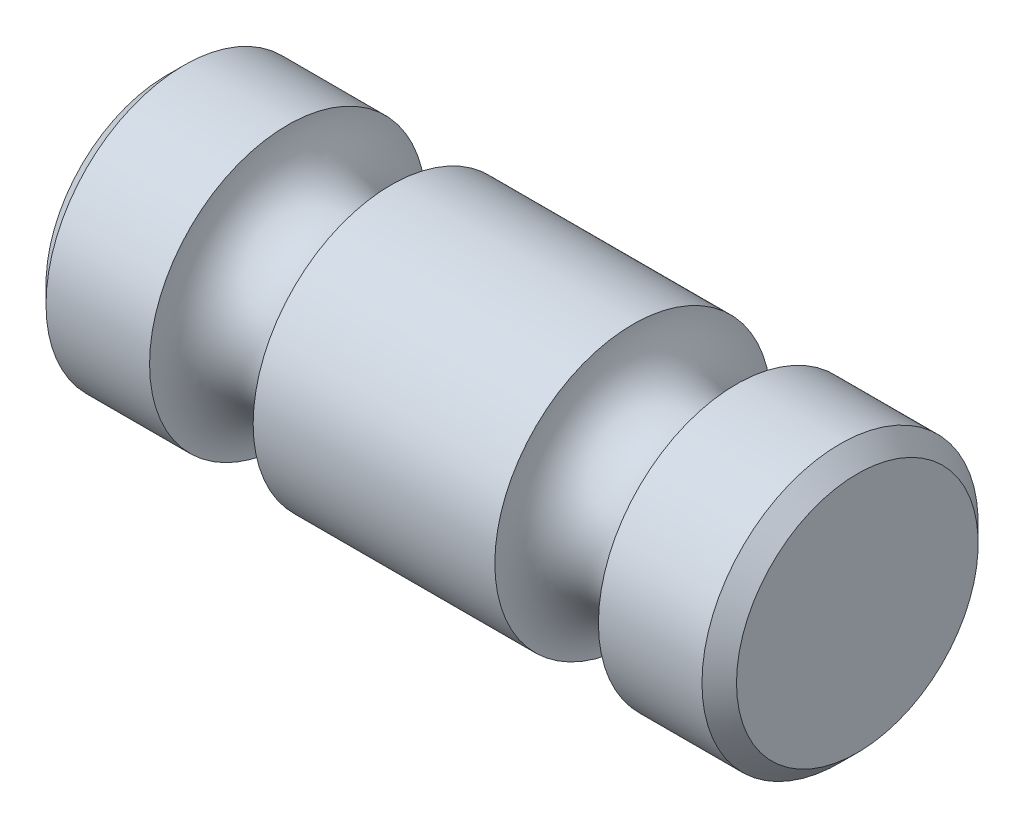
ISO-10303-21;
HEADER;
FILE_DESCRIPTION(('STEP AP214'),'2;1');
FILE_NAME('part.step','',(''),(''),'','','');
FILE_SCHEMA(('AUTOMOTIVE_DESIGN { 1 0 10303 214 1 1 1 1 }'));
ENDSEC;
DATA;
#1=APPLICATION_CONTEXT('core data for automotive mechanical design processes');
#2=APPLICATION_PROTOCOL_DEFINITION('international standard','automotive_design',2000,#1);
#3=PRODUCT_CONTEXT('',#1,'mechanical');
#4=PRODUCT('Part','Part','',(#3));
#5=PRODUCT_RELATED_PRODUCT_CATEGORY('part','',(#4));
#6=PRODUCT_DEFINITION_FORMATION('','',#4);
#7=PRODUCT_DEFINITION_CONTEXT('part definition',#1,'design');
#8=PRODUCT_DEFINITION('design','',#6,#7);
#9=PRODUCT_DEFINITION_SHAPE('','',#8);
#10=(LENGTH_UNIT() NAMED_UNIT(*) SI_UNIT(.MILLI.,.METRE.));
#11=(NAMED_UNIT(*) PLANE_ANGLE_UNIT() SI_UNIT($,.RADIAN.));
#12=(NAMED_UNIT(*) SI_UNIT($,.STERADIAN.) SOLID_ANGLE_UNIT());
#13=UNCERTAINTY_MEASURE_WITH_UNIT(LENGTH_MEASURE(1.E-05),#10,'distance_accuracy_value','');
#14=(GEOMETRIC_REPRESENTATION_CONTEXT(3) GLOBAL_UNCERTAINTY_ASSIGNED_CONTEXT((#13)) GLOBAL_UNIT_ASSIGNED_CONTEXT((#10,
#11,#12)) REPRESENTATION_CONTEXT('',''));
#15=CARTESIAN_POINT('',(0.,0.,0.));
#16=DIRECTION('',(0.,0.,1.));
#17=DIRECTION('',(1.,0.,0.));
#18=AXIS2_PLACEMENT_3D('',#15,#16,#17);
#19=CARTESIAN_POINT('',(-57.3101318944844,14.3483436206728,0.));
#20=DIRECTION('',(1.,0.,0.));
#21=DIRECTION('',(0.,0.,-1.));
#22=AXIS2_PLACEMENT_3D('',#19,#20,#21);
#23=PLANE('',#22);
#24=CARTESIAN_POINT('',(-57.3101318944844,6.34834362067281,0.));
#25=DIRECTION('',(1.,0.,0.));
#26=DIRECTION('',(0.,0.,-1.));
#27=AXIS2_PLACEMENT_3D('',#24,#25,#26);
#28=CIRCLE('',#27,7.);
#29=CARTESIAN_POINT('',(-57.3101318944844,6.34834362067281,-7.));
#30=VERTEX_POINT('',#29);
#31=EDGE_CURVE('E34',#30,#30,#28,.F.);
#32=ORIENTED_EDGE('',*,*,#31,.T.);
#33=EDGE_LOOP('',(#32));
#34=FACE_BOUND('',#33,.T.);
#35=ADVANCED_FACE('F28',(#34),#23,.F.);
#36=CARTESIAN_POINT('',(-17.3101318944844,6.34834362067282,0.));
#37=DIRECTION('',(-1.,0.,0.));
#38=DIRECTION('',(0.,0.,1.));
#39=AXIS2_PLACEMENT_3D('',#36,#37,#38);
#40=PLANE('',#39);
#41=CARTESIAN_POINT('',(-17.3101318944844,6.34834362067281,0.));
#42=DIRECTION('',(-1.,0.,0.));
#43=DIRECTION('',(0.,0.,1.));
#44=AXIS2_PLACEMENT_3D('',#41,#42,#43);
#45=CIRCLE('',#44,6.99999999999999);
#46=CARTESIAN_POINT('',(-17.3101318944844,6.34834362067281,6.99999999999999));
#47=VERTEX_POINT('',#46);
#48=EDGE_CURVE('E38',#47,#47,#45,.F.);
#49=ORIENTED_EDGE('',*,*,#48,.T.);
#50=EDGE_LOOP('',(#49));
#51=FACE_BOUND('',#50,.T.);
#52=ADVANCED_FACE('F82',(#51),#40,.F.);
#53=CARTESIAN_POINT('',(-63.2212490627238,6.34834362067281,0.));
#54=DIRECTION('',(-1.,0.,0.));
#55=DIRECTION('',(0.,0.,1.));
#56=AXIS2_PLACEMENT_3D('',#53,#54,#55);
#57=CYLINDRICAL_SURFACE('',#56,8.);
#58=CARTESIAN_POINT('',(-18.3101318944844,6.34834362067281,0.));
#59=DIRECTION('',(-1.,0.,0.));
#60=DIRECTION('',(0.,0.,1.));
#61=AXIS2_PLACEMENT_3D('',#58,#59,#60);
#62=CIRCLE('',#61,8.);
#63=CARTESIAN_POINT('',(-18.3101318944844,6.34834362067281,8.));
#64=VERTEX_POINT('',#63);
#65=EDGE_CURVE('E42',#64,#64,#62,.T.);
#66=ORIENTED_EDGE('',*,*,#65,.T.);
#67=EDGE_LOOP('',(#66));
#68=FACE_BOUND('',#67,.T.);
#69=CARTESIAN_POINT('',(-24.3101318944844,6.34834362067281,0.));
#70=DIRECTION('',(-1.,0.,0.));
#71=DIRECTION('',(0.,0.,1.));
#72=AXIS2_PLACEMENT_3D('',#69,#70,#71);
#73=CIRCLE('',#72,8.);
#74=CARTESIAN_POINT('',(-24.3101318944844,6.34834362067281,8.));
#75=VERTEX_POINT('',#74);
#76=EDGE_CURVE('E47',#75,#75,#73,.T.);
#77=ORIENTED_EDGE('',*,*,#76,.F.);
#78=EDGE_LOOP('',(#77));
#79=FACE_BOUND('',#78,.T.);
#80=ADVANCED_FACE('F77',(#68,#79),#57,.T.);
#81=CARTESIAN_POINT('',(-27.3101318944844,6.34834362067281,0.));
#82=DIRECTION('',(-1.,0.,0.));
#83=DIRECTION('',(0.,0.,1.));
#84=AXIS2_PLACEMENT_3D('',#81,#82,#83);
#85=TOROIDAL_SURFACE('',#84,7.99999999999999,3.);
#86=CARTESIAN_POINT('',(-30.3101318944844,6.34834362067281,0.));
#87=DIRECTION('',(-1.,0.,0.));
#88=DIRECTION('',(0.,0.,1.));
#89=AXIS2_PLACEMENT_3D('',#86,#87,#88);
#90=CIRCLE('',#89,8.);
#91=CARTESIAN_POINT('',(-30.3101318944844,6.34834362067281,8.));
#92=VERTEX_POINT('',#91);
#93=EDGE_CURVE('E50',#92,#92,#90,.T.);
#94=ORIENTED_EDGE('',*,*,#93,.F.);
#95=EDGE_LOOP('',(#94));
#96=FACE_BOUND('',#95,.T.);
#97=ORIENTED_EDGE('',*,*,#76,.T.);
#98=EDGE_LOOP('',(#97));
#99=FACE_BOUND('',#98,.T.);
#100=ADVANCED_FACE('F71',(#96,#99),#85,.F.);
#101=CARTESIAN_POINT('',(-63.2212490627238,6.34834362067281,0.));
#102=DIRECTION('',(-1.,0.,0.));
#103=DIRECTION('',(0.,0.,1.));
#104=AXIS2_PLACEMENT_3D('',#101,#102,#103);
#105=CYLINDRICAL_SURFACE('',#104,8.);
#106=CARTESIAN_POINT('',(-44.3101318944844,6.34834362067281,0.));
#107=DIRECTION('',(-1.,0.,0.));
#108=DIRECTION('',(0.,0.,1.));
#109=AXIS2_PLACEMENT_3D('',#106,#107,#108);
#110=CIRCLE('',#109,8.);
#111=CARTESIAN_POINT('',(-44.3101318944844,6.34834362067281,8.));
#112=VERTEX_POINT('',#111);
#113=EDGE_CURVE('E53',#112,#112,#110,.T.);
#114=ORIENTED_EDGE('',*,*,#113,.F.);
#115=EDGE_LOOP('',(#114));
#116=FACE_BOUND('',#115,.T.);
#117=ORIENTED_EDGE('',*,*,#93,.T.);
#118=EDGE_LOOP('',(#117));
#119=FACE_BOUND('',#118,.T.);
#120=ADVANCED_FACE('F65',(#116,#119),#105,.T.);
#121=CARTESIAN_POINT('',(-47.3101318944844,6.34834362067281,0.));
#122=DIRECTION('',(-1.,0.,0.));
#123=DIRECTION('',(0.,0.,1.));
#124=AXIS2_PLACEMENT_3D('',#121,#122,#123);
#125=TOROIDAL_SURFACE('',#124,7.99999999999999,3.);
#126=CARTESIAN_POINT('',(-50.3101318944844,6.34834362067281,0.));
#127=DIRECTION('',(-1.,0.,0.));
#128=DIRECTION('',(0.,0.,1.));
#129=AXIS2_PLACEMENT_3D('',#126,#127,#128);
#130=CIRCLE('',#129,8.);
#131=CARTESIAN_POINT('',(-50.3101318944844,6.34834362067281,8.));
#132=VERTEX_POINT('',#131);
#133=EDGE_CURVE('E56',#132,#132,#130,.T.);
#134=ORIENTED_EDGE('',*,*,#133,.F.);
#135=EDGE_LOOP('',(#134));
#136=FACE_BOUND('',#135,.T.);
#137=ORIENTED_EDGE('',*,*,#113,.T.);
#138=EDGE_LOOP('',(#137));
#139=FACE_BOUND('',#138,.T.);
#140=ADVANCED_FACE('F62',(#136,#139),#125,.F.);
#141=CARTESIAN_POINT('',(-63.2212490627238,6.34834362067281,0.));
#142=DIRECTION('',(-1.,0.,0.));
#143=DIRECTION('',(0.,0.,1.));
#144=AXIS2_PLACEMENT_3D('',#141,#142,#143);
#145=CYLINDRICAL_SURFACE('',#144,8.);
#146=CARTESIAN_POINT('',(-56.3101318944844,6.34834362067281,0.));
#147=DIRECTION('',(1.,0.,0.));
#148=DIRECTION('',(0.,0.,-1.));
#149=AXIS2_PLACEMENT_3D('',#146,#147,#148);
#150=CIRCLE('',#149,8.);
#151=CARTESIAN_POINT('',(-56.3101318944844,6.34834362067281,-8.));
#152=VERTEX_POINT('',#151);
#153=EDGE_CURVE('E10',#152,#152,#150,.T.);
#154=ORIENTED_EDGE('',*,*,#153,.T.);
#155=EDGE_LOOP('',(#154));
#156=FACE_BOUND('',#155,.T.);
#157=ORIENTED_EDGE('',*,*,#133,.T.);
#158=EDGE_LOOP('',(#157));
#159=FACE_BOUND('',#158,.T.);
#160=ADVANCED_FACE('F60',(#156,#159),#145,.T.);
#161=CARTESIAN_POINT('',(-18.3101318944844,6.34834362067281,0.));
#162=DIRECTION('',(-1.,0.,0.));
#163=DIRECTION('',(0.,0.,1.));
#164=AXIS2_PLACEMENT_3D('',#161,#162,#163);
#165=CONICAL_SURFACE('',#164,8.,0.78539816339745);
#166=ORIENTED_EDGE('',*,*,#48,.F.);
#167=EDGE_LOOP('',(#166));
#168=FACE_BOUND('',#167,.T.);
#169=ORIENTED_EDGE('',*,*,#65,.F.);
#170=EDGE_LOOP('',(#169));
#171=FACE_BOUND('',#170,.T.);
#172=ADVANCED_FACE('F111',(#168,#171),#165,.T.);
#173=CARTESIAN_POINT('',(-57.3101318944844,6.34834362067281,0.));
#174=DIRECTION('',(1.,0.,0.));
#175=DIRECTION('',(0.,0.,-1.));
#176=AXIS2_PLACEMENT_3D('',#173,#174,#175);
#177=CONICAL_SURFACE('',#176,7.,0.785398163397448);
#178=ORIENTED_EDGE('',*,*,#153,.F.);
#179=EDGE_LOOP('',(#178));
#180=FACE_BOUND('',#179,.T.);
#181=ORIENTED_EDGE('',*,*,#31,.F.);
#182=EDGE_LOOP('',(#181));
#183=FACE_BOUND('',#182,.T.);
#184=ADVANCED_FACE('F121',(#180,#183),#177,.T.);
#185=CLOSED_SHELL('',(#35,#52,#80,#100,#120,#140,#160,#172,#184));
#186=MANIFOLD_SOLID_BREP('B2',#185);
#187=ADVANCED_BREP_SHAPE_REPRESENTATION('',(#18,#186),#14);
#188=SHAPE_DEFINITION_REPRESENTATION(#9,#187);
ENDSEC;
END-ISO-10303-21;
